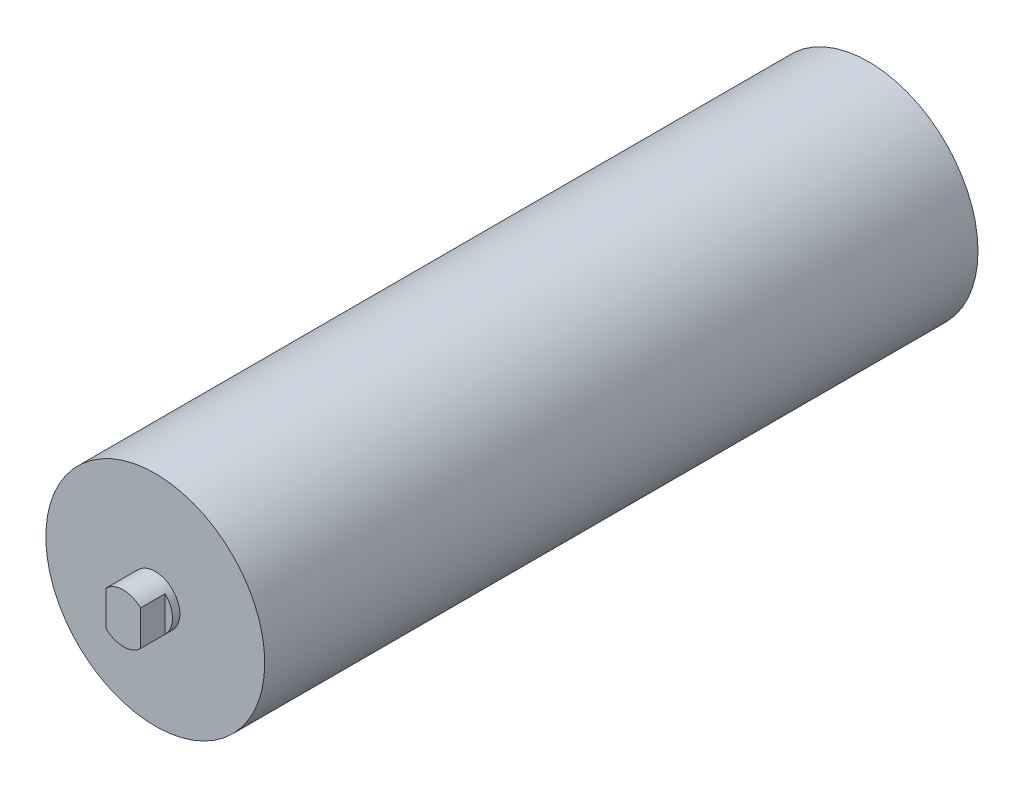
ISO-10303-21;
HEADER;
FILE_DESCRIPTION(('STEP AP214'),'2;1');
FILE_NAME('part.step','',(''),(''),'','','');
FILE_SCHEMA(('AUTOMOTIVE_DESIGN { 1 0 10303 214 1 1 1 1 }'));
ENDSEC;
DATA;
#1=APPLICATION_CONTEXT('core data for automotive mechanical design processes');
#2=APPLICATION_PROTOCOL_DEFINITION('international standard','automotive_design',2000,#1);
#3=PRODUCT_CONTEXT('',#1,'mechanical');
#4=PRODUCT('Part','Part','',(#3));
#5=PRODUCT_RELATED_PRODUCT_CATEGORY('part','',(#4));
#6=PRODUCT_DEFINITION_FORMATION('','',#4);
#7=PRODUCT_DEFINITION_CONTEXT('part definition',#1,'design');
#8=PRODUCT_DEFINITION('design','',#6,#7);
#9=PRODUCT_DEFINITION_SHAPE('','',#8);
#10=(LENGTH_UNIT() NAMED_UNIT(*) SI_UNIT(.MILLI.,.METRE.));
#11=(NAMED_UNIT(*) PLANE_ANGLE_UNIT() SI_UNIT($,.RADIAN.));
#12=(NAMED_UNIT(*) SI_UNIT($,.STERADIAN.) SOLID_ANGLE_UNIT());
#13=UNCERTAINTY_MEASURE_WITH_UNIT(LENGTH_MEASURE(1.E-05),#10,'distance_accuracy_value','');
#14=(GEOMETRIC_REPRESENTATION_CONTEXT(3) GLOBAL_UNCERTAINTY_ASSIGNED_CONTEXT((#13)) GLOBAL_UNIT_ASSIGNED_CONTEXT((#10,
#11,#12)) REPRESENTATION_CONTEXT('',''));
#15=CARTESIAN_POINT('',(0.,0.,0.));
#16=DIRECTION('',(0.,0.,1.));
#17=DIRECTION('',(1.,0.,0.));
#18=AXIS2_PLACEMENT_3D('',#15,#16,#17);
#19=CARTESIAN_POINT('',(0.,0.,303.));
#20=DIRECTION('',(0.,0.,-1.));
#21=DIRECTION('',(-1.,0.,0.));
#22=AXIS2_PLACEMENT_3D('',#19,#20,#21);
#23=CYLINDRICAL_SURFACE('',#22,10.);
#24=CARTESIAN_POINT('',(0.,0.,290.));
#25=DIRECTION('',(0.,0.,1.));
#26=DIRECTION('',(1.,0.,0.));
#27=AXIS2_PLACEMENT_3D('',#24,#25,#26);
#28=CIRCLE('',#27,10.);
#29=CARTESIAN_POINT('',(10.,0.,290.));
#30=VERTEX_POINT('',#29);
#31=EDGE_CURVE('E115',#30,#30,#28,.T.);
#32=ORIENTED_EDGE('',*,*,#31,.T.);
#33=EDGE_LOOP('',(#32));
#34=FACE_BOUND('',#33,.T.);
#35=DIRECTION('',(0.,0.,-1.));
#36=VECTOR('',#35,1.);
#37=CARTESIAN_POINT('',(-7.,7.14142842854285,303.));
#38=LINE('',#37,#36);
#39=CARTESIAN_POINT('',(-7.,7.14142842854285,303.));
#40=VERTEX_POINT('',#39);
#41=CARTESIAN_POINT('',(-7.,7.14142842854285,293.));
#42=VERTEX_POINT('',#41);
#43=EDGE_CURVE('E147',#40,#42,#38,.T.);
#44=ORIENTED_EDGE('',*,*,#43,.F.);
#45=CARTESIAN_POINT('',(0.,0.,303.));
#46=DIRECTION('',(0.,0.,1.));
#47=DIRECTION('',(1.,0.,0.));
#48=AXIS2_PLACEMENT_3D('',#45,#46,#47);
#49=CIRCLE('',#48,10.);
#50=CARTESIAN_POINT('',(7.,7.14142842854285,303.));
#51=VERTEX_POINT('',#50);
#52=EDGE_CURVE('E114',#51,#40,#49,.T.);
#53=ORIENTED_EDGE('',*,*,#52,.F.);
#54=DIRECTION('',(0.,0.,-1.));
#55=VECTOR('',#54,1.);
#56=CARTESIAN_POINT('',(7.,7.14142842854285,303.));
#57=LINE('',#56,#55);
#58=CARTESIAN_POINT('',(7.,7.14142842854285,293.));
#59=VERTEX_POINT('',#58);
#60=EDGE_CURVE('E55',#59,#51,#57,.F.);
#61=ORIENTED_EDGE('',*,*,#60,.F.);
#62=CARTESIAN_POINT('',(0.,0.,293.));
#63=DIRECTION('',(0.,0.,1.));
#64=DIRECTION('',(1.,0.,0.));
#65=AXIS2_PLACEMENT_3D('',#62,#63,#64);
#66=CIRCLE('',#65,10.);
#67=CARTESIAN_POINT('',(7.,-7.14142842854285,293.));
#68=VERTEX_POINT('',#67);
#69=EDGE_CURVE('E36',#68,#59,#66,.T.);
#70=ORIENTED_EDGE('',*,*,#69,.F.);
#71=DIRECTION('',(0.,0.,-1.));
#72=VECTOR('',#71,1.);
#73=CARTESIAN_POINT('',(7.,-7.14142842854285,303.));
#74=LINE('',#73,#72);
#75=CARTESIAN_POINT('',(7.,-7.14142842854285,303.));
#76=VERTEX_POINT('',#75);
#77=EDGE_CURVE('E98',#76,#68,#74,.T.);
#78=ORIENTED_EDGE('',*,*,#77,.F.);
#79=CARTESIAN_POINT('',(-7.,-7.14142842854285,303.));
#80=VERTEX_POINT('',#79);
#81=EDGE_CURVE('E111',#80,#76,#49,.T.);
#82=ORIENTED_EDGE('',*,*,#81,.F.);
#83=DIRECTION('',(0.,0.,-1.));
#84=VECTOR('',#83,1.);
#85=CARTESIAN_POINT('',(-7.,-7.14142842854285,303.));
#86=LINE('',#85,#84);
#87=CARTESIAN_POINT('',(-7.,-7.14142842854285,293.));
#88=VERTEX_POINT('',#87);
#89=EDGE_CURVE('E47',#88,#80,#86,.F.);
#90=ORIENTED_EDGE('',*,*,#89,.F.);
#91=EDGE_CURVE('E11',#42,#88,#66,.T.);
#92=ORIENTED_EDGE('',*,*,#91,.F.);
#93=EDGE_LOOP('',(#44,#53,#61,#70,#78,#82,#90,#92));
#94=FACE_BOUND('',#93,.T.);
#95=ADVANCED_FACE('F32',(#34,#94),#23,.T.);
#96=CARTESIAN_POINT('',(0.,0.,303.));
#97=DIRECTION('',(0.,0.,1.));
#98=DIRECTION('',(1.,0.,0.));
#99=AXIS2_PLACEMENT_3D('',#96,#97,#98);
#100=PLANE('',#99);
#101=ORIENTED_EDGE('',*,*,#52,.T.);
#102=DIRECTION('',(0.,-1.,0.));
#103=VECTOR('',#102,1.);
#104=CARTESIAN_POINT('',(-7.,0.,303.));
#105=LINE('',#104,#103);
#106=EDGE_CURVE('E104',#40,#80,#105,.T.);
#107=ORIENTED_EDGE('',*,*,#106,.T.);
#108=ORIENTED_EDGE('',*,*,#81,.T.);
#109=DIRECTION('',(0.,1.,0.));
#110=VECTOR('',#109,1.);
#111=CARTESIAN_POINT('',(7.,0.,303.));
#112=LINE('',#111,#110);
#113=EDGE_CURVE('E95',#76,#51,#112,.T.);
#114=ORIENTED_EDGE('',*,*,#113,.T.);
#115=EDGE_LOOP('',(#101,#107,#108,#114));
#116=FACE_BOUND('',#115,.T.);
#117=ADVANCED_FACE('F113',(#116),#100,.T.);
#118=CARTESIAN_POINT('',(0.,0.,-13.));
#119=DIRECTION('',(0.,0.,1.));
#120=DIRECTION('',(1.,0.,0.));
#121=AXIS2_PLACEMENT_3D('',#118,#119,#120);
#122=CYLINDRICAL_SURFACE('',#121,10.);
#123=CARTESIAN_POINT('',(0.,0.,0.));
#124=DIRECTION('',(0.,0.,1.));
#125=DIRECTION('',(1.,0.,0.));
#126=AXIS2_PLACEMENT_3D('',#123,#124,#125);
#127=CIRCLE('',#126,10.);
#128=CARTESIAN_POINT('',(10.,0.,0.));
#129=VERTEX_POINT('',#128);
#130=EDGE_CURVE('E128',#129,#129,#127,.F.);
#131=ORIENTED_EDGE('',*,*,#130,.T.);
#132=EDGE_LOOP('',(#131));
#133=FACE_BOUND('',#132,.T.);
#134=DIRECTION('',(0.,0.,1.));
#135=VECTOR('',#134,1.);
#136=CARTESIAN_POINT('',(7.,7.14142842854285,-13.));
#137=LINE('',#136,#135);
#138=CARTESIAN_POINT('',(7.,7.14142842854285,-13.));
#139=VERTEX_POINT('',#138);
#140=CARTESIAN_POINT('',(7.,7.14142842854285,-3.));
#141=VERTEX_POINT('',#140);
#142=EDGE_CURVE('E161',#139,#141,#137,.T.);
#143=ORIENTED_EDGE('',*,*,#142,.F.);
#144=CARTESIAN_POINT('',(0.,0.,-13.));
#145=DIRECTION('',(0.,0.,-1.));
#146=DIRECTION('',(-1.,0.,0.));
#147=AXIS2_PLACEMENT_3D('',#144,#145,#146);
#148=CIRCLE('',#147,10.);
#149=CARTESIAN_POINT('',(-7.,7.14142842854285,-13.));
#150=VERTEX_POINT('',#149);
#151=EDGE_CURVE('E119',#150,#139,#148,.T.);
#152=ORIENTED_EDGE('',*,*,#151,.F.);
#153=DIRECTION('',(0.,0.,1.));
#154=VECTOR('',#153,1.);
#155=CARTESIAN_POINT('',(-7.,7.14142842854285,-13.));
#156=LINE('',#155,#154);
#157=CARTESIAN_POINT('',(-7.,7.14142842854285,-3.));
#158=VERTEX_POINT('',#157);
#159=EDGE_CURVE('E155',#158,#150,#156,.F.);
#160=ORIENTED_EDGE('',*,*,#159,.F.);
#161=CARTESIAN_POINT('',(0.,0.,-3.));
#162=DIRECTION('',(0.,0.,-1.));
#163=DIRECTION('',(-1.,0.,0.));
#164=AXIS2_PLACEMENT_3D('',#161,#162,#163);
#165=CIRCLE('',#164,10.);
#166=CARTESIAN_POINT('',(-7.,-7.14142842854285,-3.));
#167=VERTEX_POINT('',#166);
#168=EDGE_CURVE('E137',#167,#158,#165,.T.);
#169=ORIENTED_EDGE('',*,*,#168,.F.);
#170=DIRECTION('',(0.,0.,1.));
#171=VECTOR('',#170,1.);
#172=CARTESIAN_POINT('',(-7.,-7.14142842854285,-13.));
#173=LINE('',#172,#171);
#174=CARTESIAN_POINT('',(-7.,-7.14142842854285,-13.));
#175=VERTEX_POINT('',#174);
#176=EDGE_CURVE('E157',#175,#167,#173,.T.);
#177=ORIENTED_EDGE('',*,*,#176,.F.);
#178=CARTESIAN_POINT('',(7.,-7.14142842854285,-13.));
#179=VERTEX_POINT('',#178);
#180=EDGE_CURVE('E162',#179,#175,#148,.T.);
#181=ORIENTED_EDGE('',*,*,#180,.F.);
#182=DIRECTION('',(0.,0.,1.));
#183=VECTOR('',#182,1.);
#184=CARTESIAN_POINT('',(7.,-7.14142842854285,-13.));
#185=LINE('',#184,#183);
#186=CARTESIAN_POINT('',(7.,-7.14142842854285,-3.));
#187=VERTEX_POINT('',#186);
#188=EDGE_CURVE('E159',#187,#179,#185,.F.);
#189=ORIENTED_EDGE('',*,*,#188,.F.);
#190=EDGE_CURVE('E105',#141,#187,#165,.T.);
#191=ORIENTED_EDGE('',*,*,#190,.F.);
#192=EDGE_LOOP('',(#143,#152,#160,#169,#177,#181,#189,#191));
#193=FACE_BOUND('',#192,.T.);
#194=ADVANCED_FACE('F173',(#133,#193),#122,.T.);
#195=CARTESIAN_POINT('',(0.,0.,-13.));
#196=DIRECTION('',(0.,0.,-1.));
#197=DIRECTION('',(-1.,0.,0.));
#198=AXIS2_PLACEMENT_3D('',#195,#196,#197);
#199=PLANE('',#198);
#200=ORIENTED_EDGE('',*,*,#151,.T.);
#201=DIRECTION('',(0.,-1.,0.));
#202=VECTOR('',#201,1.);
#203=CARTESIAN_POINT('',(7.,0.,-13.));
#204=LINE('',#203,#202);
#205=EDGE_CURVE('E134',#139,#179,#204,.T.);
#206=ORIENTED_EDGE('',*,*,#205,.T.);
#207=ORIENTED_EDGE('',*,*,#180,.T.);
#208=DIRECTION('',(0.,1.,0.));
#209=VECTOR('',#208,1.);
#210=CARTESIAN_POINT('',(-7.,0.,-13.));
#211=LINE('',#210,#209);
#212=EDGE_CURVE('E131',#175,#150,#211,.T.);
#213=ORIENTED_EDGE('',*,*,#212,.T.);
#214=EDGE_LOOP('',(#200,#206,#207,#213));
#215=FACE_BOUND('',#214,.T.);
#216=ADVANCED_FACE('F168',(#215),#199,.T.);
#217=CARTESIAN_POINT('',(0.,0.,0.));
#218=DIRECTION('',(0.,0.,1.));
#219=DIRECTION('',(1.,0.,0.));
#220=AXIS2_PLACEMENT_3D('',#217,#218,#219);
#221=PLANE('',#220);
#222=CARTESIAN_POINT('',(0.,0.,0.));
#223=DIRECTION('',(0.,0.,1.));
#224=DIRECTION('',(1.,0.,0.));
#225=AXIS2_PLACEMENT_3D('',#222,#223,#224);
#226=CIRCLE('',#225,44.5);
#227=CARTESIAN_POINT('',(44.5,0.,0.));
#228=VERTEX_POINT('',#227);
#229=EDGE_CURVE('E117',#228,#228,#226,.T.);
#230=ORIENTED_EDGE('',*,*,#229,.F.);
#231=EDGE_LOOP('',(#230));
#232=FACE_BOUND('',#231,.T.);
#233=ORIENTED_EDGE('',*,*,#130,.F.);
#234=EDGE_LOOP('',(#233));
#235=FACE_BOUND('',#234,.T.);
#236=ADVANCED_FACE('F203',(#232,#235),#221,.F.);
#237=CARTESIAN_POINT('',(0.,0.,290.));
#238=DIRECTION('',(0.,0.,1.));
#239=DIRECTION('',(1.,0.,0.));
#240=AXIS2_PLACEMENT_3D('',#237,#238,#239);
#241=PLANE('',#240);
#242=CARTESIAN_POINT('',(0.,0.,290.));
#243=DIRECTION('',(0.,0.,1.));
#244=DIRECTION('',(1.,0.,0.));
#245=AXIS2_PLACEMENT_3D('',#242,#243,#244);
#246=CIRCLE('',#245,44.5);
#247=CARTESIAN_POINT('',(44.5,0.,290.));
#248=VERTEX_POINT('',#247);
#249=EDGE_CURVE('E125',#248,#248,#246,.T.);
#250=ORIENTED_EDGE('',*,*,#249,.T.);
#251=EDGE_LOOP('',(#250));
#252=FACE_BOUND('',#251,.T.);
#253=ORIENTED_EDGE('',*,*,#31,.F.);
#254=EDGE_LOOP('',(#253));
#255=FACE_BOUND('',#254,.T.);
#256=ADVANCED_FACE('F205',(#252,#255),#241,.T.);
#257=CARTESIAN_POINT('',(0.,0.,290.));
#258=DIRECTION('',(0.,0.,-1.));
#259=DIRECTION('',(-1.,0.,0.));
#260=AXIS2_PLACEMENT_3D('',#257,#258,#259);
#261=CYLINDRICAL_SURFACE('',#260,44.5);
#262=ORIENTED_EDGE('',*,*,#249,.F.);
#263=EDGE_LOOP('',(#262));
#264=FACE_BOUND('',#263,.T.);
#265=ORIENTED_EDGE('',*,*,#229,.T.);
#266=EDGE_LOOP('',(#265));
#267=FACE_BOUND('',#266,.T.);
#268=ADVANCED_FACE('F34',(#264,#267),#261,.T.);
#269=CARTESIAN_POINT('',(-7.,20.2682388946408,-3.));
#270=DIRECTION('',(-1.,0.,0.));
#271=DIRECTION('',(0.,-1.,0.));
#272=AXIS2_PLACEMENT_3D('',#269,#270,#271);
#273=PLANE('',#272);
#274=ORIENTED_EDGE('',*,*,#176,.T.);
#275=DIRECTION('',(0.,1.,0.));
#276=VECTOR('',#275,1.);
#277=CARTESIAN_POINT('',(-7.,20.2682388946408,-3.));
#278=LINE('',#277,#276);
#279=EDGE_CURVE('E152',#167,#158,#278,.T.);
#280=ORIENTED_EDGE('',*,*,#279,.T.);
#281=ORIENTED_EDGE('',*,*,#159,.T.);
#282=ORIENTED_EDGE('',*,*,#212,.F.);
#283=EDGE_LOOP('',(#274,#280,#281,#282));
#284=FACE_BOUND('',#283,.T.);
#285=ADVANCED_FACE('F179',(#284),#273,.T.);
#286=CARTESIAN_POINT('',(0.,0.,-3.));
#287=DIRECTION('',(0.,0.,-1.));
#288=DIRECTION('',(-1.,0.,0.));
#289=AXIS2_PLACEMENT_3D('',#286,#287,#288);
#290=PLANE('',#289);
#291=ORIENTED_EDGE('',*,*,#168,.T.);
#292=ORIENTED_EDGE('',*,*,#279,.F.);
#293=EDGE_LOOP('',(#291,#292));
#294=FACE_BOUND('',#293,.T.);
#295=ADVANCED_FACE('F181',(#294),#290,.T.);
#296=ORIENTED_EDGE('',*,*,#190,.T.);
#297=DIRECTION('',(0.,-1.,0.));
#298=VECTOR('',#297,1.);
#299=CARTESIAN_POINT('',(7.,20.2682388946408,-3.));
#300=LINE('',#299,#298);
#301=EDGE_CURVE('E149',#141,#187,#300,.T.);
#302=ORIENTED_EDGE('',*,*,#301,.F.);
#303=EDGE_LOOP('',(#296,#302));
#304=FACE_BOUND('',#303,.T.);
#305=ADVANCED_FACE('F183',(#304),#290,.T.);
#306=CARTESIAN_POINT('',(7.,20.2682388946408,-3.));
#307=DIRECTION('',(1.,0.,0.));
#308=DIRECTION('',(0.,1.,0.));
#309=AXIS2_PLACEMENT_3D('',#306,#307,#308);
#310=PLANE('',#309);
#311=ORIENTED_EDGE('',*,*,#142,.T.);
#312=ORIENTED_EDGE('',*,*,#301,.T.);
#313=ORIENTED_EDGE('',*,*,#188,.T.);
#314=ORIENTED_EDGE('',*,*,#205,.F.);
#315=EDGE_LOOP('',(#311,#312,#313,#314));
#316=FACE_BOUND('',#315,.T.);
#317=ADVANCED_FACE('F189',(#316),#310,.T.);
#318=CARTESIAN_POINT('',(7.,19.7786679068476,293.));
#319=DIRECTION('',(1.,0.,0.));
#320=DIRECTION('',(0.,1.,0.));
#321=AXIS2_PLACEMENT_3D('',#318,#319,#320);
#322=PLANE('',#321);
#323=ORIENTED_EDGE('',*,*,#77,.T.);
#324=DIRECTION('',(0.,1.,0.));
#325=VECTOR('',#324,1.);
#326=CARTESIAN_POINT('',(7.,19.7786679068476,293.));
#327=LINE('',#326,#325);
#328=EDGE_CURVE('E140',#68,#59,#327,.T.);
#329=ORIENTED_EDGE('',*,*,#328,.T.);
#330=ORIENTED_EDGE('',*,*,#60,.T.);
#331=ORIENTED_EDGE('',*,*,#113,.F.);
#332=EDGE_LOOP('',(#323,#329,#330,#331));
#333=FACE_BOUND('',#332,.T.);
#334=ADVANCED_FACE('F97',(#333),#322,.T.);
#335=CARTESIAN_POINT('',(0.,0.,293.));
#336=DIRECTION('',(0.,0.,1.));
#337=DIRECTION('',(1.,0.,0.));
#338=AXIS2_PLACEMENT_3D('',#335,#336,#337);
#339=PLANE('',#338);
#340=ORIENTED_EDGE('',*,*,#69,.T.);
#341=ORIENTED_EDGE('',*,*,#328,.F.);
#342=EDGE_LOOP('',(#340,#341));
#343=FACE_BOUND('',#342,.T.);
#344=ADVANCED_FACE('F139',(#343),#339,.T.);
#345=ORIENTED_EDGE('',*,*,#91,.T.);
#346=DIRECTION('',(0.,-1.,0.));
#347=VECTOR('',#346,1.);
#348=CARTESIAN_POINT('',(-7.,19.7786679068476,293.));
#349=LINE('',#348,#347);
#350=EDGE_CURVE('E141',#42,#88,#349,.T.);
#351=ORIENTED_EDGE('',*,*,#350,.F.);
#352=EDGE_LOOP('',(#345,#351));
#353=FACE_BOUND('',#352,.T.);
#354=ADVANCED_FACE('F285',(#353),#339,.T.);
#355=CARTESIAN_POINT('',(-7.,19.7786679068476,293.));
#356=DIRECTION('',(-1.,0.,0.));
#357=DIRECTION('',(0.,-1.,0.));
#358=AXIS2_PLACEMENT_3D('',#355,#356,#357);
#359=PLANE('',#358);
#360=ORIENTED_EDGE('',*,*,#43,.T.);
#361=ORIENTED_EDGE('',*,*,#350,.T.);
#362=ORIENTED_EDGE('',*,*,#89,.T.);
#363=ORIENTED_EDGE('',*,*,#106,.F.);
#364=EDGE_LOOP('',(#360,#361,#362,#363));
#365=FACE_BOUND('',#364,.T.);
#366=ADVANCED_FACE('F294',(#365),#359,.T.);
#367=CLOSED_SHELL('',(#95,#117,#194,#216,#236,#256,#268,#285,#295,#305,#317,#334,#344,#354,#366));
#368=MANIFOLD_SOLID_BREP('B2',#367);
#369=ADVANCED_BREP_SHAPE_REPRESENTATION('',(#18,#368),#14);
#370=SHAPE_DEFINITION_REPRESENTATION(#9,#369);
ENDSEC;
END-ISO-10303-21;
